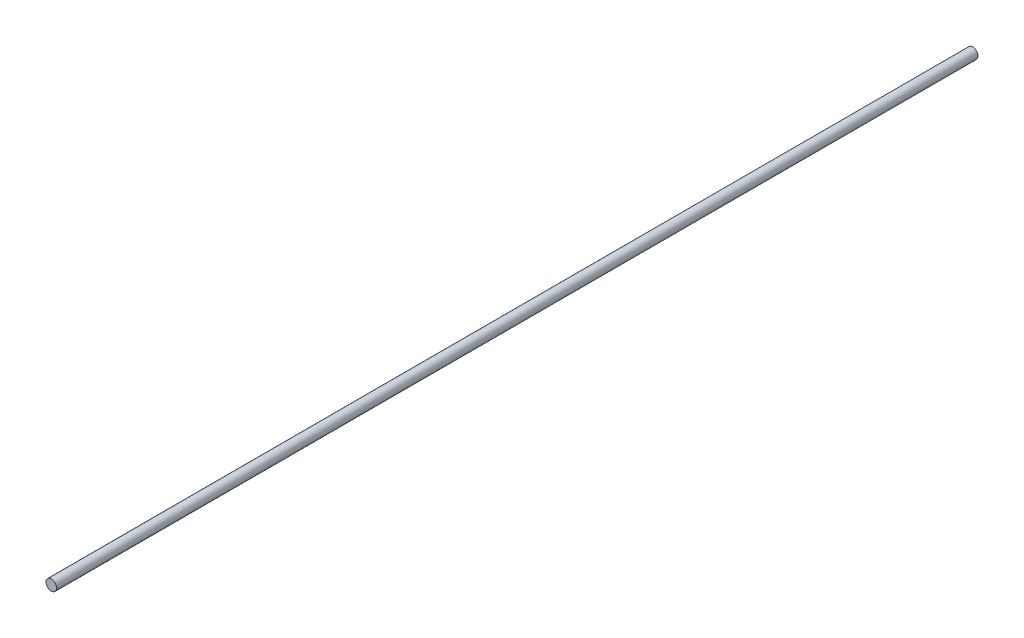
ISO-10303-21;
HEADER;
FILE_DESCRIPTION(('STEP AP214'),'2;1');
FILE_NAME('part.step','',(''),(''),'','','');
FILE_SCHEMA(('AUTOMOTIVE_DESIGN { 1 0 10303 214 1 1 1 1 }'));
ENDSEC;
DATA;
#1=APPLICATION_CONTEXT('core data for automotive mechanical design processes');
#2=APPLICATION_PROTOCOL_DEFINITION('international standard','automotive_design',2000,#1);
#3=PRODUCT_CONTEXT('',#1,'mechanical');
#4=PRODUCT('Part','Part','',(#3));
#5=PRODUCT_RELATED_PRODUCT_CATEGORY('part','',(#4));
#6=PRODUCT_DEFINITION_FORMATION('','',#4);
#7=PRODUCT_DEFINITION_CONTEXT('part definition',#1,'design');
#8=PRODUCT_DEFINITION('design','',#6,#7);
#9=PRODUCT_DEFINITION_SHAPE('','',#8);
#10=(LENGTH_UNIT() NAMED_UNIT(*) SI_UNIT(.MILLI.,.METRE.));
#11=(NAMED_UNIT(*) PLANE_ANGLE_UNIT() SI_UNIT($,.RADIAN.));
#12=(NAMED_UNIT(*) SI_UNIT($,.STERADIAN.) SOLID_ANGLE_UNIT());
#13=UNCERTAINTY_MEASURE_WITH_UNIT(LENGTH_MEASURE(1.E-05),#10,'distance_accuracy_value','');
#14=(GEOMETRIC_REPRESENTATION_CONTEXT(3) GLOBAL_UNCERTAINTY_ASSIGNED_CONTEXT((#13)) GLOBAL_UNIT_ASSIGNED_CONTEXT((#10,
#11,#12)) REPRESENTATION_CONTEXT('',''));
#15=CARTESIAN_POINT('',(0.,0.,0.));
#16=DIRECTION('',(0.,0.,1.));
#17=DIRECTION('',(1.,0.,0.));
#18=AXIS2_PLACEMENT_3D('',#15,#16,#17);
#19=CARTESIAN_POINT('',(0.,0.,-5250.));
#20=DIRECTION('',(0.,0.,1.));
#21=DIRECTION('',(1.,0.,0.));
#22=AXIS2_PLACEMENT_3D('',#19,#20,#21);
#23=CYLINDRICAL_SURFACE('',#22,30.);
#24=CARTESIAN_POINT('',(0.,0.,-5250.));
#25=DIRECTION('',(0.,0.,1.));
#26=DIRECTION('',(1.,0.,0.));
#27=AXIS2_PLACEMENT_3D('',#24,#25,#26);
#28=CIRCLE('',#27,30.);
#29=CARTESIAN_POINT('',(30.,0.,-5250.));
#30=VERTEX_POINT('',#29);
#31=EDGE_CURVE('E10',#30,#30,#28,.T.);
#32=ORIENTED_EDGE('',*,*,#31,.T.);
#33=EDGE_LOOP('',(#32));
#34=FACE_BOUND('',#33,.T.);
#35=CARTESIAN_POINT('',(0.,0.,0.));
#36=DIRECTION('',(0.,0.,1.));
#37=DIRECTION('',(1.,0.,0.));
#38=AXIS2_PLACEMENT_3D('',#35,#36,#37);
#39=CIRCLE('',#38,30.);
#40=CARTESIAN_POINT('',(30.,0.,0.));
#41=VERTEX_POINT('',#40);
#42=EDGE_CURVE('E40',#41,#41,#39,.T.);
#43=ORIENTED_EDGE('',*,*,#42,.F.);
#44=EDGE_LOOP('',(#43));
#45=FACE_BOUND('',#44,.T.);
#46=ADVANCED_FACE('F37',(#34,#45),#23,.T.);
#47=CARTESIAN_POINT('',(0.,0.,-5250.));
#48=DIRECTION('',(0.,0.,1.));
#49=DIRECTION('',(1.,0.,0.));
#50=AXIS2_PLACEMENT_3D('',#47,#48,#49);
#51=PLANE('',#50);
#52=ORIENTED_EDGE('',*,*,#31,.F.);
#53=EDGE_LOOP('',(#52));
#54=FACE_BOUND('',#53,.T.);
#55=ADVANCED_FACE('F54',(#54),#51,.F.);
#56=CARTESIAN_POINT('',(0.,0.,0.));
#57=DIRECTION('',(0.,0.,1.));
#58=DIRECTION('',(1.,0.,0.));
#59=AXIS2_PLACEMENT_3D('',#56,#57,#58);
#60=PLANE('',#59);
#61=ORIENTED_EDGE('',*,*,#42,.T.);
#62=EDGE_LOOP('',(#61));
#63=FACE_BOUND('',#62,.T.);
#64=ADVANCED_FACE('F51',(#63),#60,.T.);
#65=CLOSED_SHELL('',(#46,#55,#64));
#66=MANIFOLD_SOLID_BREP('B2',#65);
#67=ADVANCED_BREP_SHAPE_REPRESENTATION('',(#18,#66),#14);
#68=SHAPE_DEFINITION_REPRESENTATION(#9,#67);
ENDSEC;
END-ISO-10303-21;
